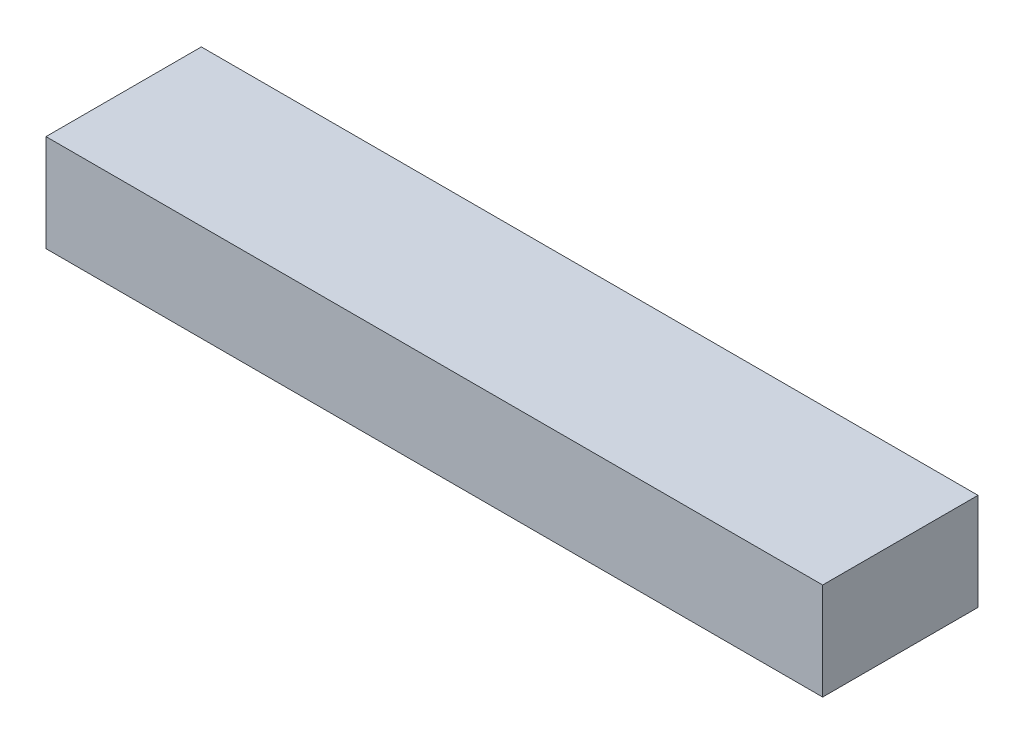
ISO-10303-21;
HEADER;
FILE_DESCRIPTION(('STEP AP214'),'2;1');
FILE_NAME('part.step','',(''),(''),'','','');
FILE_SCHEMA(('AUTOMOTIVE_DESIGN { 1 0 10303 214 1 1 1 1 }'));
ENDSEC;
DATA;
#1=APPLICATION_CONTEXT('core data for automotive mechanical design processes');
#2=APPLICATION_PROTOCOL_DEFINITION('international standard','automotive_design',2000,#1);
#3=PRODUCT_CONTEXT('',#1,'mechanical');
#4=PRODUCT('Part','Part','',(#3));
#5=PRODUCT_RELATED_PRODUCT_CATEGORY('part','',(#4));
#6=PRODUCT_DEFINITION_FORMATION('','',#4);
#7=PRODUCT_DEFINITION_CONTEXT('part definition',#1,'design');
#8=PRODUCT_DEFINITION('design','',#6,#7);
#9=PRODUCT_DEFINITION_SHAPE('','',#8);
#10=(LENGTH_UNIT() NAMED_UNIT(*) SI_UNIT(.MILLI.,.METRE.));
#11=(NAMED_UNIT(*) PLANE_ANGLE_UNIT() SI_UNIT($,.RADIAN.));
#12=(NAMED_UNIT(*) SI_UNIT($,.STERADIAN.) SOLID_ANGLE_UNIT());
#13=UNCERTAINTY_MEASURE_WITH_UNIT(LENGTH_MEASURE(1.E-05),#10,'distance_accuracy_value','');
#14=(GEOMETRIC_REPRESENTATION_CONTEXT(3) GLOBAL_UNCERTAINTY_ASSIGNED_CONTEXT((#13)) GLOBAL_UNIT_ASSIGNED_CONTEXT((#10,
#11,#12)) REPRESENTATION_CONTEXT('',''));
#15=CARTESIAN_POINT('',(0.,0.,0.));
#16=DIRECTION('',(0.,0.,1.));
#17=DIRECTION('',(1.,0.,0.));
#18=AXIS2_PLACEMENT_3D('',#15,#16,#17);
#19=CARTESIAN_POINT('',(0.,0.,8.));
#20=DIRECTION('',(1.,0.,0.));
#21=DIRECTION('',(0.,0.,-1.));
#22=AXIS2_PLACEMENT_3D('',#19,#20,#21);
#23=PLANE('',#22);
#24=DIRECTION('',(0.,-1.,0.));
#25=VECTOR('',#24,1.);
#26=CARTESIAN_POINT('',(0.,0.,0.));
#27=LINE('',#26,#25);
#28=CARTESIAN_POINT('',(0.,5.,0.));
#29=VERTEX_POINT('',#28);
#30=CARTESIAN_POINT('',(0.,0.,0.));
#31=VERTEX_POINT('',#30);
#32=EDGE_CURVE('E94',#29,#31,#27,.T.);
#33=ORIENTED_EDGE('',*,*,#32,.T.);
#34=DIRECTION('',(0.,0.,-1.));
#35=VECTOR('',#34,1.);
#36=CARTESIAN_POINT('',(0.,0.,8.));
#37=LINE('',#36,#35);
#38=CARTESIAN_POINT('',(0.,0.,8.));
#39=VERTEX_POINT('',#38);
#40=EDGE_CURVE('E11',#39,#31,#37,.T.);
#41=ORIENTED_EDGE('',*,*,#40,.F.);
#42=DIRECTION('',(0.,-1.,0.));
#43=VECTOR('',#42,1.);
#44=CARTESIAN_POINT('',(0.,0.,8.));
#45=LINE('',#44,#43);
#46=CARTESIAN_POINT('',(0.,5.,8.));
#47=VERTEX_POINT('',#46);
#48=EDGE_CURVE('E82',#47,#39,#45,.T.);
#49=ORIENTED_EDGE('',*,*,#48,.F.);
#50=DIRECTION('',(0.,0.,-1.));
#51=VECTOR('',#50,1.);
#52=CARTESIAN_POINT('',(0.,5.,8.));
#53=LINE('',#52,#51);
#54=EDGE_CURVE('E90',#47,#29,#53,.T.);
#55=ORIENTED_EDGE('',*,*,#54,.T.);
#56=EDGE_LOOP('',(#33,#41,#49,#55));
#57=FACE_BOUND('',#56,.T.);
#58=ADVANCED_FACE('F31',(#57),#23,.F.);
#59=CARTESIAN_POINT('',(0.,0.,8.));
#60=DIRECTION('',(0.,1.,0.));
#61=DIRECTION('',(0.,0.,1.));
#62=AXIS2_PLACEMENT_3D('',#59,#60,#61);
#63=PLANE('',#62);
#64=DIRECTION('',(1.,0.,0.));
#65=VECTOR('',#64,1.);
#66=CARTESIAN_POINT('',(0.,0.,0.));
#67=LINE('',#66,#65);
#68=CARTESIAN_POINT('',(40.,0.,0.));
#69=VERTEX_POINT('',#68);
#70=EDGE_CURVE('E86',#31,#69,#67,.T.);
#71=ORIENTED_EDGE('',*,*,#70,.T.);
#72=DIRECTION('',(0.,0.,-1.));
#73=VECTOR('',#72,1.);
#74=CARTESIAN_POINT('',(40.,0.,8.));
#75=LINE('',#74,#73);
#76=CARTESIAN_POINT('',(40.,0.,8.));
#77=VERTEX_POINT('',#76);
#78=EDGE_CURVE('E39',#77,#69,#75,.T.);
#79=ORIENTED_EDGE('',*,*,#78,.F.);
#80=DIRECTION('',(1.,0.,0.));
#81=VECTOR('',#80,1.);
#82=CARTESIAN_POINT('',(0.,0.,8.));
#83=LINE('',#82,#81);
#84=EDGE_CURVE('E77',#39,#77,#83,.T.);
#85=ORIENTED_EDGE('',*,*,#84,.F.);
#86=ORIENTED_EDGE('',*,*,#40,.T.);
#87=EDGE_LOOP('',(#71,#79,#85,#86));
#88=FACE_BOUND('',#87,.T.);
#89=ADVANCED_FACE('F85',(#88),#63,.F.);
#90=CARTESIAN_POINT('',(40.,0.,8.));
#91=DIRECTION('',(-1.,0.,0.));
#92=DIRECTION('',(0.,0.,1.));
#93=AXIS2_PLACEMENT_3D('',#90,#91,#92);
#94=PLANE('',#93);
#95=DIRECTION('',(0.,1.,0.));
#96=VECTOR('',#95,1.);
#97=CARTESIAN_POINT('',(40.,0.,0.));
#98=LINE('',#97,#96);
#99=CARTESIAN_POINT('',(40.,5.,0.));
#100=VERTEX_POINT('',#99);
#101=EDGE_CURVE('E64',#69,#100,#98,.T.);
#102=ORIENTED_EDGE('',*,*,#101,.T.);
#103=DIRECTION('',(0.,0.,-1.));
#104=VECTOR('',#103,1.);
#105=CARTESIAN_POINT('',(40.,5.,8.));
#106=LINE('',#105,#104);
#107=CARTESIAN_POINT('',(40.,5.,8.));
#108=VERTEX_POINT('',#107);
#109=EDGE_CURVE('E87',#108,#100,#106,.T.);
#110=ORIENTED_EDGE('',*,*,#109,.F.);
#111=DIRECTION('',(0.,1.,0.));
#112=VECTOR('',#111,1.);
#113=CARTESIAN_POINT('',(40.,0.,8.));
#114=LINE('',#113,#112);
#115=EDGE_CURVE('E80',#77,#108,#114,.T.);
#116=ORIENTED_EDGE('',*,*,#115,.F.);
#117=ORIENTED_EDGE('',*,*,#78,.T.);
#118=EDGE_LOOP('',(#102,#110,#116,#117));
#119=FACE_BOUND('',#118,.T.);
#120=ADVANCED_FACE('F88',(#119),#94,.F.);
#121=CARTESIAN_POINT('',(0.,5.,8.));
#122=DIRECTION('',(0.,-1.,0.));
#123=DIRECTION('',(0.,0.,-1.));
#124=AXIS2_PLACEMENT_3D('',#121,#122,#123);
#125=PLANE('',#124);
#126=DIRECTION('',(-1.,0.,0.));
#127=VECTOR('',#126,1.);
#128=CARTESIAN_POINT('',(0.,5.,0.));
#129=LINE('',#128,#127);
#130=EDGE_CURVE('E70',#100,#29,#129,.T.);
#131=ORIENTED_EDGE('',*,*,#130,.T.);
#132=ORIENTED_EDGE('',*,*,#54,.F.);
#133=DIRECTION('',(-1.,0.,0.));
#134=VECTOR('',#133,1.);
#135=CARTESIAN_POINT('',(0.,5.,8.));
#136=LINE('',#135,#134);
#137=EDGE_CURVE('E47',#108,#47,#136,.T.);
#138=ORIENTED_EDGE('',*,*,#137,.F.);
#139=ORIENTED_EDGE('',*,*,#109,.T.);
#140=EDGE_LOOP('',(#131,#132,#138,#139));
#141=FACE_BOUND('',#140,.T.);
#142=ADVANCED_FACE('F101',(#141),#125,.F.);
#143=CARTESIAN_POINT('',(0.,5.,8.));
#144=DIRECTION('',(0.,0.,-1.));
#145=DIRECTION('',(-1.,0.,0.));
#146=AXIS2_PLACEMENT_3D('',#143,#144,#145);
#147=PLANE('',#146);
#148=ORIENTED_EDGE('',*,*,#48,.T.);
#149=ORIENTED_EDGE('',*,*,#84,.T.);
#150=ORIENTED_EDGE('',*,*,#115,.T.);
#151=ORIENTED_EDGE('',*,*,#137,.T.);
#152=EDGE_LOOP('',(#148,#149,#150,#151));
#153=FACE_BOUND('',#152,.T.);
#154=ADVANCED_FACE('F78',(#153),#147,.F.);
#155=CARTESIAN_POINT('',(0.,5.,0.));
#156=DIRECTION('',(0.,0.,-1.));
#157=DIRECTION('',(-1.,0.,0.));
#158=AXIS2_PLACEMENT_3D('',#155,#156,#157);
#159=PLANE('',#158);
#160=ORIENTED_EDGE('',*,*,#32,.F.);
#161=ORIENTED_EDGE('',*,*,#130,.F.);
#162=ORIENTED_EDGE('',*,*,#101,.F.);
#163=ORIENTED_EDGE('',*,*,#70,.F.);
#164=EDGE_LOOP('',(#160,#161,#162,#163));
#165=FACE_BOUND('',#164,.T.);
#166=ADVANCED_FACE('F104',(#165),#159,.T.);
#167=CLOSED_SHELL('',(#58,#89,#120,#142,#154,#166));
#168=MANIFOLD_SOLID_BREP('B2',#167);
#169=ADVANCED_BREP_SHAPE_REPRESENTATION('',(#18,#168),#14);
#170=SHAPE_DEFINITION_REPRESENTATION(#9,#169);
ENDSEC;
END-ISO-10303-21;
